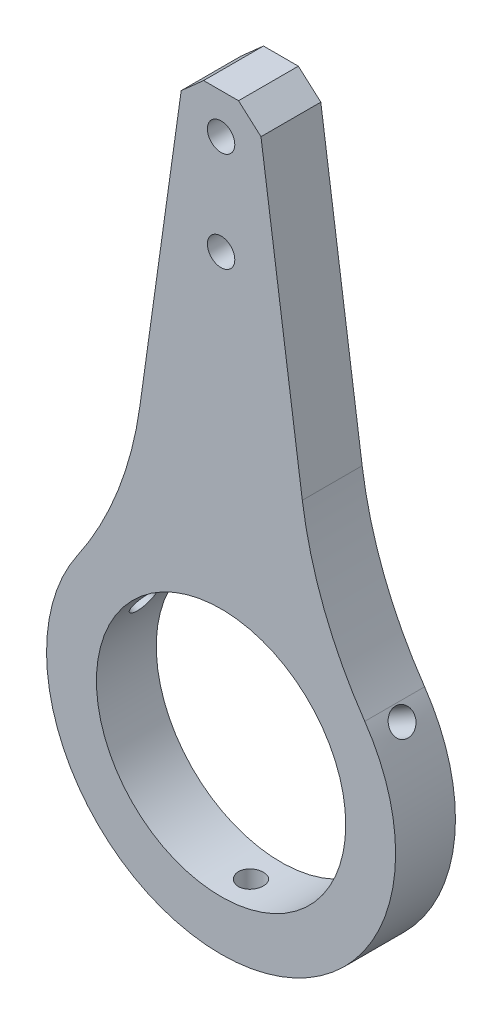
from build123d import *

# Parameters (mm, degrees)
ESQUISSE1_R                  = 25
ESQUISSE1_R_2                = 2.75
EXTRUSION1_DEPTH             = 12
ESQUISSE2_R                  = 2.5
EXTRUSION2_DEPTH             = 12
R_P_TITION_CIRCULAIRE1_COUNT = 3


with BuildPart() as part:
    # Esquisse1 → Extrusion1 (new body)
    with BuildSketch(Plane.XY):
        with BuildLine():
            Line((-16.291881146, 52.000199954), (-8, 111))
            Line((-8, 111), (-3.5, 115))
            Line((-3.5, 115), (3.5, 115))
            Line((3.5, 115), (8, 111))
            Line((8, 111), (16.291881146, 52.000199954))
            ThreePointArc((16.291881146, 52.000199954), (20.681439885, 35.203843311), (28.81517746, 19.86669444))
            ThreePointArc((28.81517746, 19.86669444), (0, -35), (-28.81517746, 19.86669444))
            ThreePointArc((-28.81517746, 19.86669444), (-20.681439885, 35.203843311), (-16.291881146, 52.000199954))
        make_face()
        Circle(ESQUISSE1_R, mode=Mode.SUBTRACT)
        with Locations((0, 87)):
            Circle(ESQUISSE1_R_2, mode=Mode.SUBTRACT)
        with Locations((0, 107)):
            Circle(ESQUISSE1_R_2, mode=Mode.SUBTRACT)
    extrude(amount=EXTRUSION1_DEPTH)

    # Esquisse2 → Extrusion2 (cut)
    with BuildSketch(Plane(origin=(0, -35, 6), x_dir=(-1, 0, 0), z_dir=(0, -1, 0))):
        with Locations(Location((0, 0, 0), (0, 0, 180))):
            Circle(ESQUISSE2_R)
    extrusion2 = extrude(amount=-EXTRUSION2_DEPTH, mode=Mode.SUBTRACT)

    # R_p_tition circulaire1: Extrusion2 ×3 about axis
    r_p_tition_circulaire1_axis = Axis((0, 0, 12), (0, 0, 1))
    for i in range(1, R_P_TITION_CIRCULAIRE1_COUNT):
        add(extrusion2.rotate(r_p_tition_circulaire1_axis, i * 360 / R_P_TITION_CIRCULAIRE1_COUNT), mode=Mode.SUBTRACT)


solid = part.part
